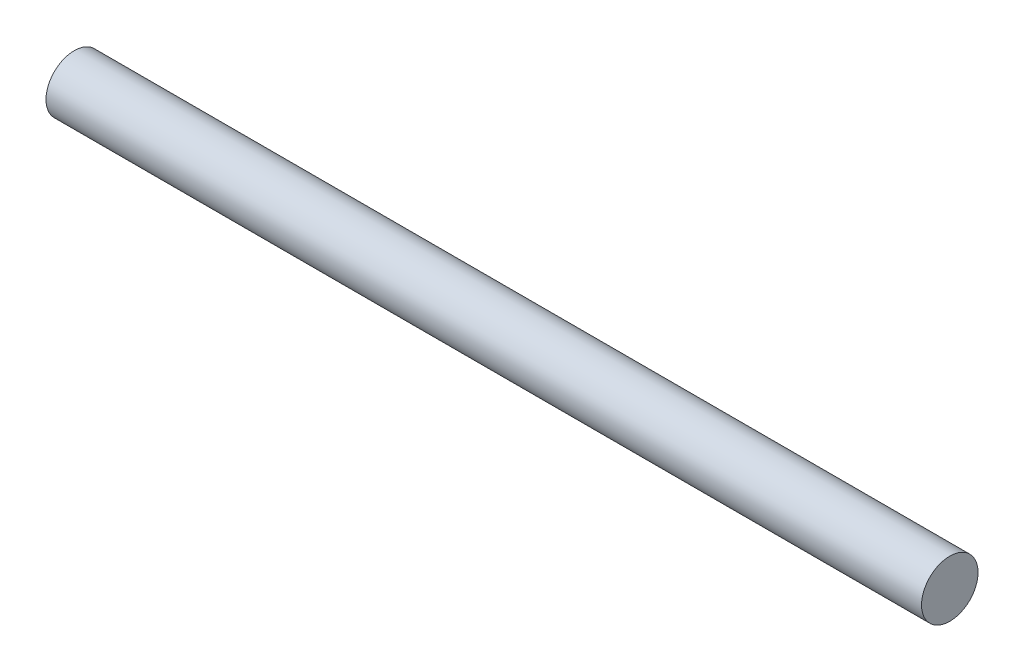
ISO-10303-21;
HEADER;
FILE_DESCRIPTION(('STEP AP214'),'2;1');
FILE_NAME('part.step','',(''),(''),'','','');
FILE_SCHEMA(('AUTOMOTIVE_DESIGN { 1 0 10303 214 1 1 1 1 }'));
ENDSEC;
DATA;
#1=APPLICATION_CONTEXT('core data for automotive mechanical design processes');
#2=APPLICATION_PROTOCOL_DEFINITION('international standard','automotive_design',2000,#1);
#3=PRODUCT_CONTEXT('',#1,'mechanical');
#4=PRODUCT('Part','Part','',(#3));
#5=PRODUCT_RELATED_PRODUCT_CATEGORY('part','',(#4));
#6=PRODUCT_DEFINITION_FORMATION('','',#4);
#7=PRODUCT_DEFINITION_CONTEXT('part definition',#1,'design');
#8=PRODUCT_DEFINITION('design','',#6,#7);
#9=PRODUCT_DEFINITION_SHAPE('','',#8);
#10=(LENGTH_UNIT() NAMED_UNIT(*) SI_UNIT(.MILLI.,.METRE.));
#11=(NAMED_UNIT(*) PLANE_ANGLE_UNIT() SI_UNIT($,.RADIAN.));
#12=(NAMED_UNIT(*) SI_UNIT($,.STERADIAN.) SOLID_ANGLE_UNIT());
#13=UNCERTAINTY_MEASURE_WITH_UNIT(LENGTH_MEASURE(1.E-05),#10,'distance_accuracy_value','');
#14=(GEOMETRIC_REPRESENTATION_CONTEXT(3) GLOBAL_UNCERTAINTY_ASSIGNED_CONTEXT((#13)) GLOBAL_UNIT_ASSIGNED_CONTEXT((#10,
#11,#12)) REPRESENTATION_CONTEXT('',''));
#15=CARTESIAN_POINT('',(0.,0.,0.));
#16=DIRECTION('',(0.,0.,1.));
#17=DIRECTION('',(1.,0.,0.));
#18=AXIS2_PLACEMENT_3D('',#15,#16,#17);
#19=CARTESIAN_POINT('',(17.6357142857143,0.,0.));
#20=DIRECTION('',(1.,0.,0.));
#21=DIRECTION('',(0.,0.,-1.));
#22=AXIS2_PLACEMENT_3D('',#19,#20,#21);
#23=PLANE('',#22);
#24=CARTESIAN_POINT('',(17.6357142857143,0.,0.));
#25=DIRECTION('',(-1.,0.,0.));
#26=DIRECTION('',(0.,0.,1.));
#27=AXIS2_PLACEMENT_3D('',#24,#25,#26);
#28=CIRCLE('',#27,1.05);
#29=CARTESIAN_POINT('',(17.6357142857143,0.,1.05));
#30=VERTEX_POINT('',#29);
#31=EDGE_CURVE('E37',#30,#30,#28,.T.);
#32=ORIENTED_EDGE('',*,*,#31,.F.);
#33=EDGE_LOOP('',(#32));
#34=FACE_BOUND('',#33,.T.);
#35=ADVANCED_FACE('F31',(#34),#23,.T.);
#36=CARTESIAN_POINT('',(-14.8928571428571,0.,0.));
#37=DIRECTION('',(-1.,0.,0.));
#38=DIRECTION('',(0.,0.,1.));
#39=AXIS2_PLACEMENT_3D('',#36,#37,#38);
#40=PLANE('',#39);
#41=CARTESIAN_POINT('',(-14.8928571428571,0.,0.));
#42=DIRECTION('',(-1.,0.,0.));
#43=DIRECTION('',(0.,0.,1.));
#44=AXIS2_PLACEMENT_3D('',#41,#42,#43);
#45=CIRCLE('',#44,1.05);
#46=CARTESIAN_POINT('',(-14.8928571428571,0.,1.05));
#47=VERTEX_POINT('',#46);
#48=EDGE_CURVE('E10',#47,#47,#45,.T.);
#49=ORIENTED_EDGE('',*,*,#48,.T.);
#50=EDGE_LOOP('',(#49));
#51=FACE_BOUND('',#50,.T.);
#52=ADVANCED_FACE('F47',(#51),#40,.T.);
#53=CARTESIAN_POINT('',(-21.9381171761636,0.,0.));
#54=DIRECTION('',(-1.,0.,0.));
#55=DIRECTION('',(0.,0.,1.));
#56=AXIS2_PLACEMENT_3D('',#53,#54,#55);
#57=CYLINDRICAL_SURFACE('',#56,1.05);
#58=ORIENTED_EDGE('',*,*,#31,.T.);
#59=EDGE_LOOP('',(#58));
#60=FACE_BOUND('',#59,.T.);
#61=ORIENTED_EDGE('',*,*,#48,.F.);
#62=EDGE_LOOP('',(#61));
#63=FACE_BOUND('',#62,.T.);
#64=ADVANCED_FACE('F43',(#60,#63),#57,.T.);
#65=CLOSED_SHELL('',(#35,#52,#64));
#66=MANIFOLD_SOLID_BREP('B2',#65);
#67=ADVANCED_BREP_SHAPE_REPRESENTATION('',(#18,#66),#14);
#68=SHAPE_DEFINITION_REPRESENTATION(#9,#67);
ENDSEC;
END-ISO-10303-21;
